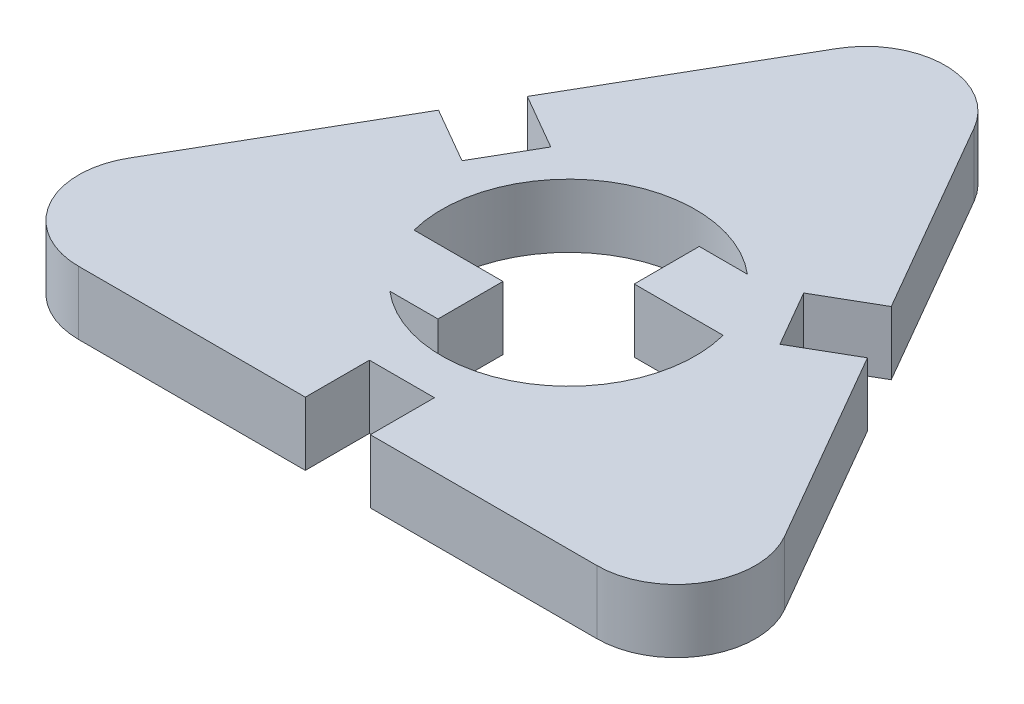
from build123d import *

# Parameters (mm, degrees)
SALIENTE_EXTRUIR1_DEPTH = 4
REDONDEO1_R             = 5


with BuildPart() as part:
    # Croquis1 → Saliente-Extruir1 (new body)
    with BuildSketch(Plane(origin=(0, 0, 0), x_dir=(1, 0, 0), z_dir=(0, 1, 0))):
        Polygon((0, 28.747658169), (-11.475, 8.872375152), (-7.97439097, 6.851297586), (-10.02439097, 3.300593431), (-13.525, 5.321670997), (-25, -14.55361202), (-2.05, -14.55361202), (-2.05, -10.511456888), (2.05, -10.511456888), (2.05, -14.55361202), (25, -14.55361202), (13.525, 5.321670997), (10.02439097, 3.300593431), (7.97439097, 6.851297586), (11.475, 8.872375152), align=None)
        with BuildLine():
            Line((7.745966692, 2), (2.140043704, 2))
            Line((2.140043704, 2), (2.140043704, 6.1))
            Line((2.140043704, 6.1), (5.175905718, 6.1))
            ThreePointArc((5.175905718, 6.1), (-4.248976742, 6.778362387), (-7.745966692, -2))
            Line((-7.745966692, -2), (-2.140043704, -2))
            Line((-2.140043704, -2), (-2.140043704, -6.1))
            Line((-2.140043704, -6.1), (-5.175905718, -6.1))
            ThreePointArc((-5.175905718, -6.1), (4.248976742, -6.778362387), (7.745966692, 2))
        make_face(mode=Mode.SUBTRACT)
    extrude(amount=SALIENTE_EXTRUIR1_DEPTH)

    # Redondeo1
    redondeo1_edges = [part.edges().sort_by_distance(p)[0] for p in [
        (-25, 2, 14.55361202),
        (0, 2, -28.747658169),
        (25, 2, 14.55361202),
    ]]
    fillet(redondeo1_edges, radius=REDONDEO1_R)


solid = part.part
